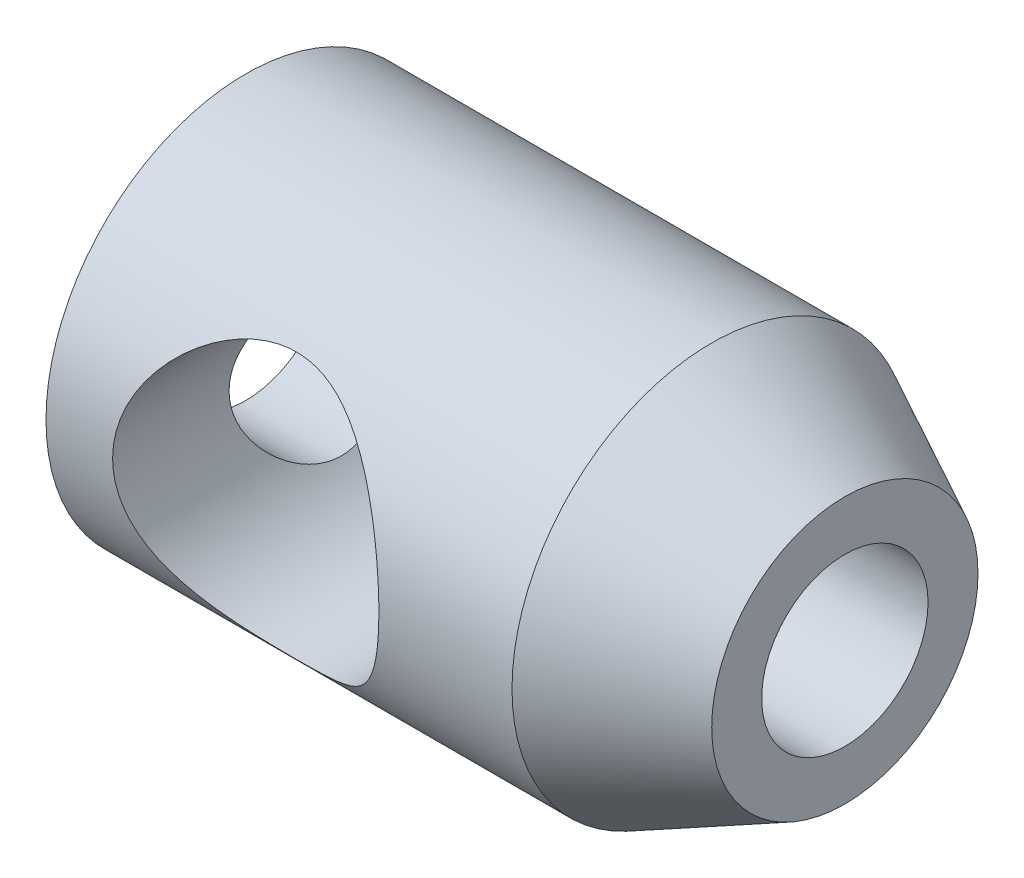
from build123d import *

# Parameters (mm, degrees)
TROU_TARAUD_M6X1_01_D   = 5
ESQUISSE4_R             = 4
ENL_V_MAT_EXTRU_1_DEPTH = 15


with BuildPart() as part:
    # Esquisse1 → R_volution1 (revolve)
    with BuildSketch(Plane.XY, mode=Mode.PRIVATE) as r_volution1_sk:
        Polygon((0, 0), (0, 6), (14, 6), (18, 4), (18, 0), align=None)
    revolve(r_volution1_sk.sketch.rotate(Axis((-27.94, 0, 0), (1, 0, 0)), 90), axis=Axis((-27.94, 0, 0), (1, 0, 0)))

    # Trou taraud_ M6x1.01 (through all)
    with Locations(Plane(origin=(18, 0, 0), x_dir=(0, 0, -1), z_dir=(1, 0, 0))):
        with Locations((0, 0)):
            Hole(TROU_TARAUD_M6X1_01_D / 2)

    # Esquisse4 → Enl_v. mat.-Extru.1 (cut, symmetric)
    with BuildSketch(Plane.XY):
        with Locations((6, 0)):
            Circle(ESQUISSE4_R)
    extrude(amount=ENL_V_MAT_EXTRU_1_DEPTH, both=True, mode=Mode.SUBTRACT)


solid = part.part
